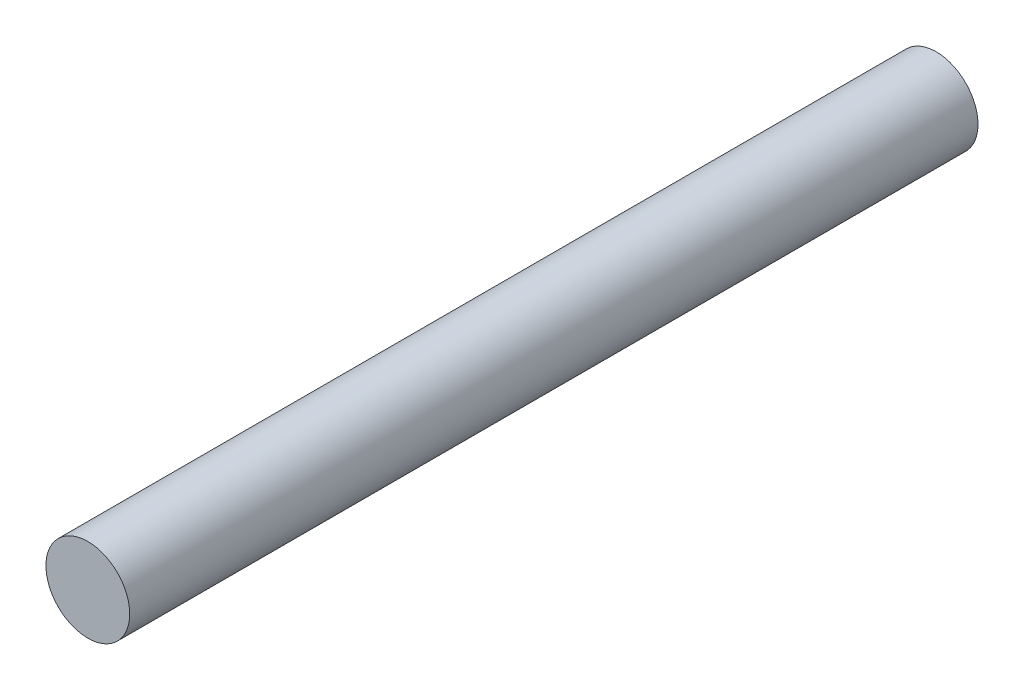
ISO-10303-21;
HEADER;
FILE_DESCRIPTION(('STEP AP214'),'2;1');
FILE_NAME('part.step','',(''),(''),'','','');
FILE_SCHEMA(('AUTOMOTIVE_DESIGN { 1 0 10303 214 1 1 1 1 }'));
ENDSEC;
DATA;
#1=APPLICATION_CONTEXT('core data for automotive mechanical design processes');
#2=APPLICATION_PROTOCOL_DEFINITION('international standard','automotive_design',2000,#1);
#3=PRODUCT_CONTEXT('',#1,'mechanical');
#4=PRODUCT('Part','Part','',(#3));
#5=PRODUCT_RELATED_PRODUCT_CATEGORY('part','',(#4));
#6=PRODUCT_DEFINITION_FORMATION('','',#4);
#7=PRODUCT_DEFINITION_CONTEXT('part definition',#1,'design');
#8=PRODUCT_DEFINITION('design','',#6,#7);
#9=PRODUCT_DEFINITION_SHAPE('','',#8);
#10=(LENGTH_UNIT() NAMED_UNIT(*) SI_UNIT(.MILLI.,.METRE.));
#11=(NAMED_UNIT(*) PLANE_ANGLE_UNIT() SI_UNIT($,.RADIAN.));
#12=(NAMED_UNIT(*) SI_UNIT($,.STERADIAN.) SOLID_ANGLE_UNIT());
#13=UNCERTAINTY_MEASURE_WITH_UNIT(LENGTH_MEASURE(1.E-05),#10,'distance_accuracy_value','');
#14=(GEOMETRIC_REPRESENTATION_CONTEXT(3) GLOBAL_UNCERTAINTY_ASSIGNED_CONTEXT((#13)) GLOBAL_UNIT_ASSIGNED_CONTEXT((#10,
#11,#12)) REPRESENTATION_CONTEXT('',''));
#15=CARTESIAN_POINT('',(0.,0.,0.));
#16=DIRECTION('',(0.,0.,1.));
#17=DIRECTION('',(1.,0.,0.));
#18=AXIS2_PLACEMENT_3D('',#15,#16,#17);
#19=CARTESIAN_POINT('',(0.,0.,162.));
#20=DIRECTION('',(0.,0.,-1.));
#21=DIRECTION('',(-1.,0.,0.));
#22=AXIS2_PLACEMENT_3D('',#19,#20,#21);
#23=CYLINDRICAL_SURFACE('',#22,8.);
#24=CARTESIAN_POINT('',(0.,0.,162.));
#25=DIRECTION('',(0.,0.,1.));
#26=DIRECTION('',(1.,0.,0.));
#27=AXIS2_PLACEMENT_3D('',#24,#25,#26);
#28=CIRCLE('',#27,8.);
#29=CARTESIAN_POINT('',(8.,0.,162.));
#30=VERTEX_POINT('',#29);
#31=EDGE_CURVE('E10',#30,#30,#28,.T.);
#32=ORIENTED_EDGE('',*,*,#31,.F.);
#33=EDGE_LOOP('',(#32));
#34=FACE_BOUND('',#33,.T.);
#35=CARTESIAN_POINT('',(0.,0.,0.));
#36=DIRECTION('',(0.,0.,1.));
#37=DIRECTION('',(1.,0.,0.));
#38=AXIS2_PLACEMENT_3D('',#35,#36,#37);
#39=CIRCLE('',#38,8.);
#40=CARTESIAN_POINT('',(8.,0.,0.));
#41=VERTEX_POINT('',#40);
#42=EDGE_CURVE('E46',#41,#41,#39,.T.);
#43=ORIENTED_EDGE('',*,*,#42,.T.);
#44=EDGE_LOOP('',(#43));
#45=FACE_BOUND('',#44,.T.);
#46=ADVANCED_FACE('F43',(#34,#45),#23,.T.);
#47=CARTESIAN_POINT('',(0.,0.,162.));
#48=DIRECTION('',(0.,0.,1.));
#49=DIRECTION('',(1.,0.,0.));
#50=AXIS2_PLACEMENT_3D('',#47,#48,#49);
#51=PLANE('',#50);
#52=ORIENTED_EDGE('',*,*,#31,.T.);
#53=EDGE_LOOP('',(#52));
#54=FACE_BOUND('',#53,.T.);
#55=ADVANCED_FACE('F60',(#54),#51,.T.);
#56=CARTESIAN_POINT('',(0.,0.,0.));
#57=DIRECTION('',(0.,0.,1.));
#58=DIRECTION('',(1.,0.,0.));
#59=AXIS2_PLACEMENT_3D('',#56,#57,#58);
#60=PLANE('',#59);
#61=ORIENTED_EDGE('',*,*,#42,.F.);
#62=EDGE_LOOP('',(#61));
#63=FACE_BOUND('',#62,.T.);
#64=ADVANCED_FACE('F58',(#63),#60,.F.);
#65=CLOSED_SHELL('',(#46,#55,#64));
#66=MANIFOLD_SOLID_BREP('B2',#65);
#67=ADVANCED_BREP_SHAPE_REPRESENTATION('',(#18,#66),#14);
#68=SHAPE_DEFINITION_REPRESENTATION(#9,#67);
ENDSEC;
END-ISO-10303-21;
